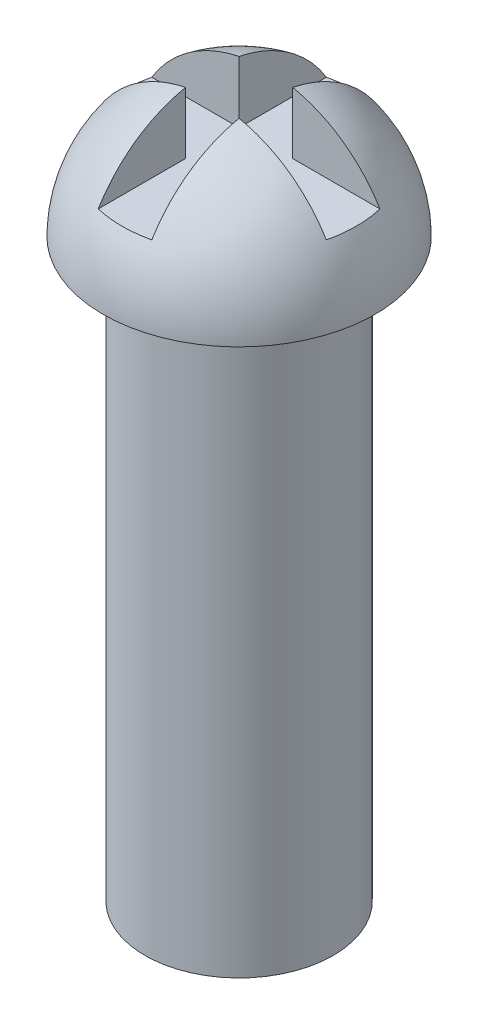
from build123d import *

# Parameters (mm, degrees)
CUT_EXTRUDE1_DEPTH      = 24.028962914
CUT_EXTRUDE1_DEPTH_BACK = 24.028962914
SKETCH3_W               = 10.3124
SKETCH3_H               = 2.032
CUT_EXTRUDE2_DEPTH      = 26.450977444


with BuildPart() as part:
    # Sketch1 → Base-Revolve (revolve)
    with BuildSketch(Plane.XY):
        with BuildLine():
            Line((5.1562, 0), (3.571875, 0))
            Line((3.571875, 0), (3.571875, -21.844))
            Line((3.571875, -21.844), (0, -21.844))
            Line((0, -21.844), (0, 5.08))
            ThreePointArc((0, 5.08), (3.619143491, 3.596659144), (5.1562, 0))
        make_face()
    revolve(axis=Axis((0, 10.110523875, 0), (0, -1, 0)))

    # Sketch2 → Cut-Extrude1 (cut, two sides: drawn at the far end of the back side and taken through both)
    with BuildSketch(Plane.XY.offset(-CUT_EXTRUDE1_DEPTH_BACK)):
        with BuildLine():
            Line((-1.016, 4.978921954), (-1.016, 2.54))
            Line((-1.016, 2.54), (1.016, 2.54))
            Line((1.016, 2.54), (1.016, 4.978921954))
            ThreePointArc((1.016, 4.978921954), (0, 5.08), (-1.016, 4.978921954))
        make_face()
    extrude(amount=CUT_EXTRUDE1_DEPTH + CUT_EXTRUDE1_DEPTH_BACK, mode=Mode.SUBTRACT)

    # Sketch3 → Cut-Extrude2 (cut, through all)
    with BuildSketch(Plane(origin=(0, 2.54, 0), x_dir=(-1, 0, 0), z_dir=(0, 1, 0))):
        Rectangle(SKETCH3_W, SKETCH3_H)
    extrude(amount=CUT_EXTRUDE2_DEPTH, mode=Mode.SUBTRACT)


solid = part.part
